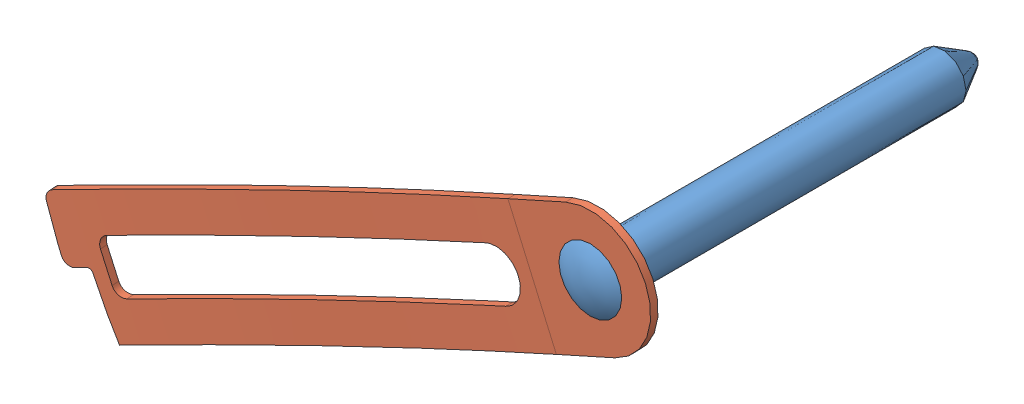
SolidWorks assembly Сборка1.sldasm, configuration По умолчанию (file format 6000). Lengths in mm.
Overall size (51.52 30.95 35.36).
2 component instances, 2 part files, 2 mates.
Components (placement in the parent):
- sear spring pin-1: sear spring pin.SLDPRT [По умолчанию] at origin size (5.56 5.56 33.5)
- sear spring-1: sear spring.SLDPRT [По умолчанию] at (0 0 -1.413) x (0.912111 0.409935 -0.002712) z (0.409936 -0.912114 -0.000026) size (51.67 3.26 10.71)
Mates (geometry in assembly coordinates):
- Концентричный1: concentric: cylinder of sear spring pin-1 through (0 0 0) axis (0 0 1) radius 1.5875; cylinder of sear spring-1 through (0 0 -0.762) axis (0 0 -1) radius 1.5875
- Совпадение1: coincident anti-aligned: plane of sear spring pin-1 through (0 2.7781 -1.397) normal (0 0 1); plane of sear spring-1 through (0 0 -1.397) normal (0 0 -1)
